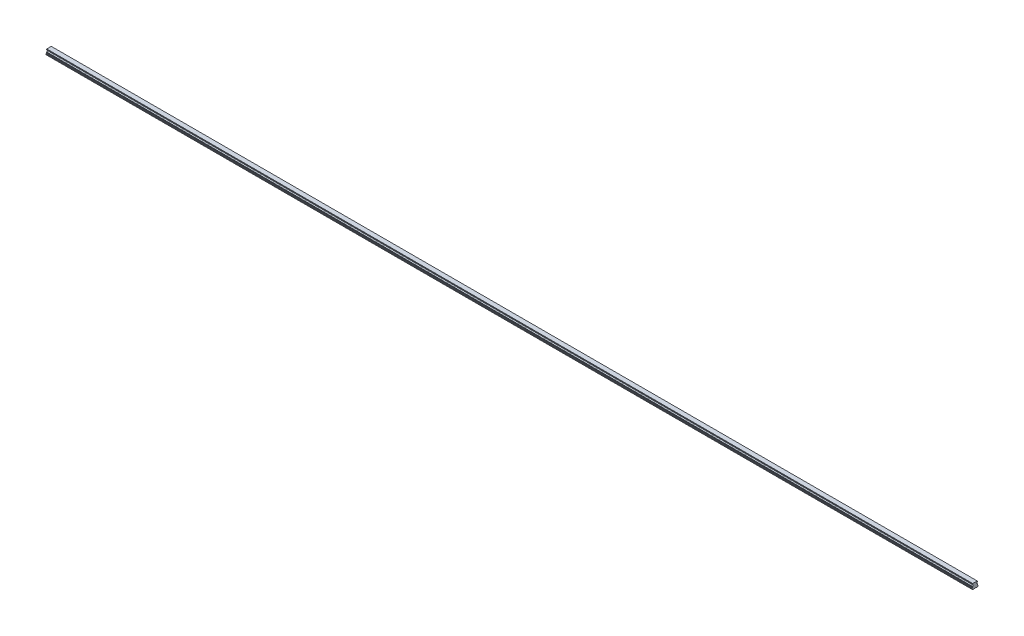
from build123d import *

# Parameters (mm, degrees)
BOSS_EXTRUDE1_DEPTH        = 3840
SKETCH3_R                  = 3
SKETCH3_R_2                = 2.5
CUT_EXTRUDE3_DEPTH         = 12
SKETCH3_2_R                = 2.5
CUT_EXTRUDE4_DEPTH         = 15
CHAMFER1_SIZE              = 0.5
LPATTERN4_COUNT            = 64
LPATTERN4_PITCH            = 60
CHAMFER1_OF_LPATTERN4_SIZE = 0.5


with BuildPart() as part:
    # Sketch1 → Boss-Extrude1 (new body)
    with BuildSketch(Plane(origin=(0, 0, 0), x_dir=(0, 0, -1), z_dir=(1, 0, 0))):
        with BuildLine():
            Line((9.375, 21.8), (-9.375, 21.8))
            Line((-9.375, 21.8), (-9.375, 20.756))
            Line((-9.375, 20.756), (-10, 19.415683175))
            Line((-10, 19.415683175), (-10, 17.685449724))
            ThreePointArc((-10, 17.685449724), (-7.2, 14.6), (-10, 11.514550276))
            Line((-10, 11.514550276), (-10, 9.784316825))
            Line((-10, 9.784316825), (-9.375, 8.444))
            Line((-9.375, 8.444), (-9.922688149, 6.4))
            Line((-9.922688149, 6.4), (-12.5, 5.489338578))
            Line((-12.5, 5.489338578), (-12.5, 2.65))
            Line((-12.5, 2.65), (-9.85, 0))
            Line((-9.85, 0), (-5.5, 0))
            Line((-5.5, 0), (-5, 0.5))
            Line((-5, 0.5), (5, 0.5))
            Line((5, 0.5), (5.5, 0))
            Line((5.5, 0), (9.85, 0))
            Line((9.85, 0), (12.5, 2.65))
            Line((12.5, 2.65), (12.5, 5.489338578))
            Line((12.5, 5.489338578), (9.922688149, 6.4))
            Line((9.922688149, 6.4), (9.375, 8.444))
            Line((9.375, 8.444), (10, 9.784316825))
            Line((10, 9.784316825), (10, 11.514550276))
            ThreePointArc((10, 11.514550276), (7.2, 14.6), (10, 17.685449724))
            Line((10, 17.685449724), (10, 19.415683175))
            Line((10, 19.415683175), (9.375, 20.756))
            Line((9.375, 20.756), (9.375, 21.8))
        make_face()
    extrude(amount=BOSS_EXTRUDE1_DEPTH)

    # Sketch3 → Cut-Extrude3 (cut)
    with BuildSketch(Plane.XZ):
        with Locations(Location((30, 0, 0), (0, 0, 270))):
            Circle(SKETCH3_R)
        with Locations(Location((30, 0, 0), (0, 0, 270))):
            Circle(SKETCH3_R_2, mode=Mode.SUBTRACT)
    cut_extrude3 = extrude(amount=-CUT_EXTRUDE3_DEPTH, mode=Mode.SUBTRACT)

    # Sketch3_2 → Cut-Extrude4 (cut)
    with BuildSketch(Plane.XZ):
        with Locations(Location((30, 0, 0), (0, 0, 270))):
            Circle(SKETCH3_2_R)
    cut_extrude4 = extrude(amount=-CUT_EXTRUDE4_DEPTH, mode=Mode.SUBTRACT)

    # Cut-Extrude5 cone 1 section (on through the dimple's axis) → Cut-Extrude5 (revolve, cut)
    with BuildSketch(Plane(origin=(30, 15, 0), x_dir=(0, 0, -1), z_dir=(1, 0, 0))):
        Polygon((0, 0), (2.5, 0), (0, 1.443375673), align=None)
    cut_extrude5 = revolve(axis=Axis((30, 15, 0), (0, 1, 0)), mode=Mode.SUBTRACT)

    # Chamfer1
    chamfer1_edges = [part.edges().sort_by_distance(p)[0] for p in [
        (30, 0.5, 3),
    ]]
    chamfer(chamfer1_edges, length=CHAMFER1_SIZE)

    # LPattern4: Cut-Extrude3, Cut-Extrude4, Cut-Extrude5 ×64
    with Locations(*[(i * LPATTERN4_PITCH, 0, 0) for i in range(1, LPATTERN4_COUNT)]):
        add(cut_extrude3, mode=Mode.SUBTRACT)
        add(cut_extrude4, mode=Mode.SUBTRACT)
        add(cut_extrude5, mode=Mode.SUBTRACT)

    # Chamfer1 of LPattern4
    chamfer1_of_lpattern4_edges = [part.edges().sort_by_distance(p)[0] for p in [
        (90, 0.5, 3),
        (150, 0.5, 3),
        (210, 0.5, 3),
        (270, 0.5, 3),
        (330, 0.5, 3),
        (390, 0.5, 3),
        (450, 0.5, 3),
        (510, 0.5, 3),
        (570, 0.5, 3),
        (630, 0.5, 3),
        (690, 0.5, 3),
        (750, 0.5, 3),
        (810, 0.5, 3),
        (870, 0.5, 3),
        (930, 0.5, 3),
        (990, 0.5, 3),
        (1050, 0.5, 3),
        (1110, 0.5, 3),
        (1170, 0.5, 3),
        (1230, 0.5, 3),
        (1290, 0.5, 3),
        (1350, 0.5, 3),
        (1410, 0.5, 3),
        (1470, 0.5, 3),
        (1530, 0.5, 3),
        (1590, 0.5, 3),
        (1650, 0.5, 3),
        (1710, 0.5, 3),
        (1770, 0.5, 3),
        (1830, 0.5, 3),
        (1890, 0.5, 3),
        (1950, 0.5, 3),
        (2010, 0.5, 3),
        (2070, 0.5, 3),
        (2130, 0.5, 3),
        (2190, 0.5, 3),
        (2250, 0.5, 3),
        (2310, 0.5, 3),
        (2370, 0.5, 3),
        (2430, 0.5, 3),
        (2490, 0.5, 3),
        (2550, 0.5, 3),
        (2610, 0.5, 3),
        (2670, 0.5, 3),
        (2730, 0.5, 3),
        (2790, 0.5, 3),
        (2850, 0.5, 3),
        (2910, 0.5, 3),
        (2970, 0.5, 3),
        (3030, 0.5, 3),
        (3090, 0.5, 3),
        (3150, 0.5, 3),
        (3210, 0.5, 3),
        (3270, 0.5, 3),
        (3330, 0.5, 3),
        (3390, 0.5, 3),
        (3450, 0.5, 3),
        (3510, 0.5, 3),
        (3570, 0.5, 3),
        (3630, 0.5, 3),
        (3690, 0.5, 3),
        (3750, 0.5, 3),
        (3810, 0.5, 3),
    ]]
    chamfer(chamfer1_of_lpattern4_edges, length=CHAMFER1_OF_LPATTERN4_SIZE)


solid = part.part
